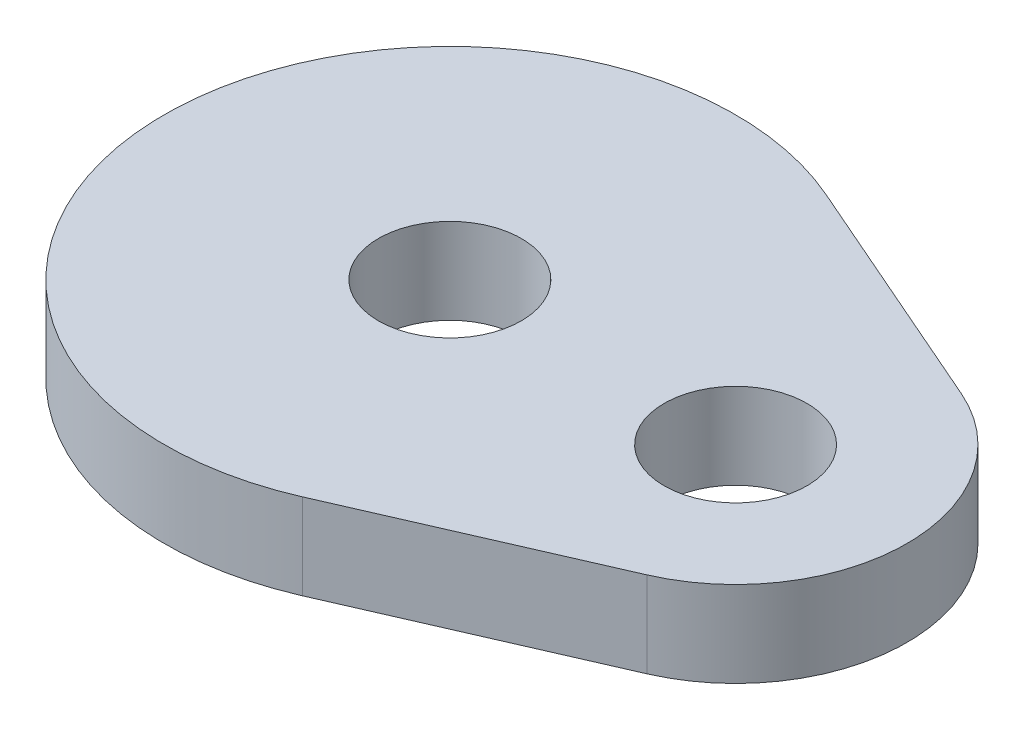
ISO-10303-21;
HEADER;
FILE_DESCRIPTION(('STEP AP214'),'2;1');
FILE_NAME('part.step','',(''),(''),'','','');
FILE_SCHEMA(('AUTOMOTIVE_DESIGN { 1 0 10303 214 1 1 1 1 }'));
ENDSEC;
DATA;
#1=APPLICATION_CONTEXT('core data for automotive mechanical design processes');
#2=APPLICATION_PROTOCOL_DEFINITION('international standard','automotive_design',2000,#1);
#3=PRODUCT_CONTEXT('',#1,'mechanical');
#4=PRODUCT('Part','Part','',(#3));
#5=PRODUCT_RELATED_PRODUCT_CATEGORY('part','',(#4));
#6=PRODUCT_DEFINITION_FORMATION('','',#4);
#7=PRODUCT_DEFINITION_CONTEXT('part definition',#1,'design');
#8=PRODUCT_DEFINITION('design','',#6,#7);
#9=PRODUCT_DEFINITION_SHAPE('','',#8);
#10=(LENGTH_UNIT() NAMED_UNIT(*) SI_UNIT(.MILLI.,.METRE.));
#11=(NAMED_UNIT(*) PLANE_ANGLE_UNIT() SI_UNIT($,.RADIAN.));
#12=(NAMED_UNIT(*) SI_UNIT($,.STERADIAN.) SOLID_ANGLE_UNIT());
#13=UNCERTAINTY_MEASURE_WITH_UNIT(LENGTH_MEASURE(1.E-05),#10,'distance_accuracy_value','');
#14=(GEOMETRIC_REPRESENTATION_CONTEXT(3) GLOBAL_UNCERTAINTY_ASSIGNED_CONTEXT((#13)) GLOBAL_UNIT_ASSIGNED_CONTEXT((#10,
#11,#12)) REPRESENTATION_CONTEXT('',''));
#15=CARTESIAN_POINT('',(0.,0.,0.));
#16=DIRECTION('',(0.,0.,1.));
#17=DIRECTION('',(1.,0.,0.));
#18=AXIS2_PLACEMENT_3D('',#15,#16,#17);
#19=CARTESIAN_POINT('',(0.,3.,0.));
#20=DIRECTION('',(0.,1.,0.));
#21=DIRECTION('',(0.,0.,1.));
#22=AXIS2_PLACEMENT_3D('',#19,#20,#21);
#23=PLANE('',#22);
#24=CARTESIAN_POINT('',(0.,3.,0.));
#25=DIRECTION('',(0.,1.,0.));
#26=DIRECTION('',(0.,0.,1.));
#27=AXIS2_PLACEMENT_3D('',#24,#25,#26);
#28=CIRCLE('',#27,2.5);
#29=CARTESIAN_POINT('',(0.,3.,2.5));
#30=VERTEX_POINT('',#29);
#31=EDGE_CURVE('E91',#30,#30,#28,.T.);
#32=ORIENTED_EDGE('',*,*,#31,.F.);
#33=EDGE_LOOP('',(#32));
#34=FACE_BOUND('',#33,.T.);
#35=CARTESIAN_POINT('',(0.,3.,0.));
#36=DIRECTION('',(0.,1.,0.));
#37=DIRECTION('',(0.,0.,1.));
#38=AXIS2_PLACEMENT_3D('',#35,#36,#37);
#39=CIRCLE('',#38,10.);
#40=CARTESIAN_POINT('',(4.,3.,-9.16515138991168));
#41=VERTEX_POINT('',#40);
#42=CARTESIAN_POINT('',(4.,3.,9.16515138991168));
#43=VERTEX_POINT('',#42);
#44=EDGE_CURVE('E101',#41,#43,#39,.T.);
#45=ORIENTED_EDGE('',*,*,#44,.T.);
#46=DIRECTION('',(0.916515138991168,0.,-0.4));
#47=VECTOR('',#46,1.);
#48=CARTESIAN_POINT('',(4.,3.,9.16515138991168));
#49=LINE('',#48,#47);
#50=CARTESIAN_POINT('',(12.4,3.,5.49909083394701));
#51=VERTEX_POINT('',#50);
#52=EDGE_CURVE('E86',#43,#51,#49,.T.);
#53=ORIENTED_EDGE('',*,*,#52,.T.);
#54=CARTESIAN_POINT('',(10.,3.,0.));
#55=DIRECTION('',(0.,1.,0.));
#56=DIRECTION('',(0.,0.,1.));
#57=AXIS2_PLACEMENT_3D('',#54,#55,#56);
#58=CIRCLE('',#57,6.);
#59=CARTESIAN_POINT('',(12.4,3.,-5.49909083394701));
#60=VERTEX_POINT('',#59);
#61=EDGE_CURVE('E52',#51,#60,#58,.T.);
#62=ORIENTED_EDGE('',*,*,#61,.T.);
#63=DIRECTION('',(-0.916515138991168,0.,-0.4));
#64=VECTOR('',#63,1.);
#65=CARTESIAN_POINT('',(4.,3.,-9.16515138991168));
#66=LINE('',#65,#64);
#67=EDGE_CURVE('E47',#60,#41,#66,.T.);
#68=ORIENTED_EDGE('',*,*,#67,.T.);
#69=EDGE_LOOP('',(#45,#53,#62,#68));
#70=FACE_BOUND('',#69,.T.);
#71=CARTESIAN_POINT('',(10.,3.,0.));
#72=DIRECTION('',(0.,1.,0.));
#73=DIRECTION('',(0.,0.,1.));
#74=AXIS2_PLACEMENT_3D('',#71,#72,#73);
#75=CIRCLE('',#74,2.5);
#76=CARTESIAN_POINT('',(10.,3.,2.5));
#77=VERTEX_POINT('',#76);
#78=EDGE_CURVE('E119',#77,#77,#75,.T.);
#79=ORIENTED_EDGE('',*,*,#78,.F.);
#80=EDGE_LOOP('',(#79));
#81=FACE_BOUND('',#80,.T.);
#82=ADVANCED_FACE('F32',(#34,#70,#81),#23,.T.);
#83=CARTESIAN_POINT('',(0.,0.,0.));
#84=DIRECTION('',(0.,1.,0.));
#85=DIRECTION('',(0.,0.,1.));
#86=AXIS2_PLACEMENT_3D('',#83,#84,#85);
#87=PLANE('',#86);
#88=CARTESIAN_POINT('',(0.,0.,0.));
#89=DIRECTION('',(0.,1.,0.));
#90=DIRECTION('',(0.,0.,1.));
#91=AXIS2_PLACEMENT_3D('',#88,#89,#90);
#92=CIRCLE('',#91,2.5);
#93=CARTESIAN_POINT('',(0.,0.,2.5));
#94=VERTEX_POINT('',#93);
#95=EDGE_CURVE('E94',#94,#94,#92,.T.);
#96=ORIENTED_EDGE('',*,*,#95,.T.);
#97=EDGE_LOOP('',(#96));
#98=FACE_BOUND('',#97,.T.);
#99=CARTESIAN_POINT('',(0.,0.,0.));
#100=DIRECTION('',(0.,1.,0.));
#101=DIRECTION('',(0.,0.,1.));
#102=AXIS2_PLACEMENT_3D('',#99,#100,#101);
#103=CIRCLE('',#102,10.);
#104=CARTESIAN_POINT('',(4.,0.,-9.16515138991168));
#105=VERTEX_POINT('',#104);
#106=CARTESIAN_POINT('',(4.,0.,9.16515138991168));
#107=VERTEX_POINT('',#106);
#108=EDGE_CURVE('E78',#105,#107,#103,.T.);
#109=ORIENTED_EDGE('',*,*,#108,.F.);
#110=DIRECTION('',(-0.916515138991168,0.,-0.4));
#111=VECTOR('',#110,1.);
#112=CARTESIAN_POINT('',(4.,0.,-9.16515138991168));
#113=LINE('',#112,#111);
#114=CARTESIAN_POINT('',(12.4,0.,-5.49909083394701));
#115=VERTEX_POINT('',#114);
#116=EDGE_CURVE('E99',#115,#105,#113,.T.);
#117=ORIENTED_EDGE('',*,*,#116,.F.);
#118=CARTESIAN_POINT('',(10.,0.,0.));
#119=DIRECTION('',(0.,1.,0.));
#120=DIRECTION('',(0.,0.,1.));
#121=AXIS2_PLACEMENT_3D('',#118,#119,#120);
#122=CIRCLE('',#121,6.);
#123=CARTESIAN_POINT('',(12.4,0.,5.49909083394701));
#124=VERTEX_POINT('',#123);
#125=EDGE_CURVE('E79',#124,#115,#122,.T.);
#126=ORIENTED_EDGE('',*,*,#125,.F.);
#127=DIRECTION('',(0.916515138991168,0.,-0.4));
#128=VECTOR('',#127,1.);
#129=CARTESIAN_POINT('',(4.,0.,9.16515138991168));
#130=LINE('',#129,#128);
#131=EDGE_CURVE('E73',#107,#124,#130,.T.);
#132=ORIENTED_EDGE('',*,*,#131,.F.);
#133=EDGE_LOOP('',(#109,#117,#126,#132));
#134=FACE_BOUND('',#133,.T.);
#135=CARTESIAN_POINT('',(10.,0.,0.));
#136=DIRECTION('',(0.,1.,0.));
#137=DIRECTION('',(0.,0.,1.));
#138=AXIS2_PLACEMENT_3D('',#135,#136,#137);
#139=CIRCLE('',#138,2.5);
#140=CARTESIAN_POINT('',(10.,0.,2.5));
#141=VERTEX_POINT('',#140);
#142=EDGE_CURVE('E121',#141,#141,#139,.T.);
#143=ORIENTED_EDGE('',*,*,#142,.T.);
#144=EDGE_LOOP('',(#143));
#145=FACE_BOUND('',#144,.T.);
#146=ADVANCED_FACE('F74',(#98,#134,#145),#87,.F.);
#147=CARTESIAN_POINT('',(0.,3.,0.));
#148=DIRECTION('',(0.,-1.,0.));
#149=DIRECTION('',(0.,0.,-1.));
#150=AXIS2_PLACEMENT_3D('',#147,#148,#149);
#151=CYLINDRICAL_SURFACE('',#150,10.);
#152=ORIENTED_EDGE('',*,*,#108,.T.);
#153=DIRECTION('',(0.,-1.,0.));
#154=VECTOR('',#153,1.);
#155=CARTESIAN_POINT('',(4.,3.,9.16515138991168));
#156=LINE('',#155,#154);
#157=EDGE_CURVE('E11',#43,#107,#156,.T.);
#158=ORIENTED_EDGE('',*,*,#157,.F.);
#159=ORIENTED_EDGE('',*,*,#44,.F.);
#160=DIRECTION('',(0.,-1.,0.));
#161=VECTOR('',#160,1.);
#162=CARTESIAN_POINT('',(4.,3.,-9.16515138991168));
#163=LINE('',#162,#161);
#164=EDGE_CURVE('E90',#41,#105,#163,.T.);
#165=ORIENTED_EDGE('',*,*,#164,.T.);
#166=EDGE_LOOP('',(#152,#158,#159,#165));
#167=FACE_BOUND('',#166,.T.);
#168=ADVANCED_FACE('F34',(#167),#151,.T.);
#169=CARTESIAN_POINT('',(4.,3.,9.16515138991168));
#170=DIRECTION('',(-0.4,0.,-0.916515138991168));
#171=DIRECTION('',(-0.916515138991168,0.,0.4));
#172=AXIS2_PLACEMENT_3D('',#169,#170,#171);
#173=PLANE('',#172);
#174=ORIENTED_EDGE('',*,*,#131,.T.);
#175=DIRECTION('',(0.,-1.,0.));
#176=VECTOR('',#175,1.);
#177=CARTESIAN_POINT('',(12.4,3.,5.49909083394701));
#178=LINE('',#177,#176);
#179=EDGE_CURVE('E40',#51,#124,#178,.T.);
#180=ORIENTED_EDGE('',*,*,#179,.F.);
#181=ORIENTED_EDGE('',*,*,#52,.F.);
#182=ORIENTED_EDGE('',*,*,#157,.T.);
#183=EDGE_LOOP('',(#174,#180,#181,#182));
#184=FACE_BOUND('',#183,.T.);
#185=ADVANCED_FACE('F85',(#184),#173,.F.);
#186=CARTESIAN_POINT('',(10.,3.,0.));
#187=DIRECTION('',(0.,-1.,0.));
#188=DIRECTION('',(0.,0.,-1.));
#189=AXIS2_PLACEMENT_3D('',#186,#187,#188);
#190=CYLINDRICAL_SURFACE('',#189,6.);
#191=ORIENTED_EDGE('',*,*,#125,.T.);
#192=DIRECTION('',(0.,-1.,0.));
#193=VECTOR('',#192,1.);
#194=CARTESIAN_POINT('',(12.4,3.,-5.49909083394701));
#195=LINE('',#194,#193);
#196=EDGE_CURVE('E107',#60,#115,#195,.T.);
#197=ORIENTED_EDGE('',*,*,#196,.F.);
#198=ORIENTED_EDGE('',*,*,#61,.F.);
#199=ORIENTED_EDGE('',*,*,#179,.T.);
#200=EDGE_LOOP('',(#191,#197,#198,#199));
#201=FACE_BOUND('',#200,.T.);
#202=ADVANCED_FACE('F110',(#201),#190,.T.);
#203=CARTESIAN_POINT('',(4.,3.,-9.16515138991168));
#204=DIRECTION('',(-0.4,0.,0.916515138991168));
#205=DIRECTION('',(0.916515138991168,0.,0.4));
#206=AXIS2_PLACEMENT_3D('',#203,#204,#205);
#207=PLANE('',#206);
#208=ORIENTED_EDGE('',*,*,#116,.T.);
#209=ORIENTED_EDGE('',*,*,#164,.F.);
#210=ORIENTED_EDGE('',*,*,#67,.F.);
#211=ORIENTED_EDGE('',*,*,#196,.T.);
#212=EDGE_LOOP('',(#208,#209,#210,#211));
#213=FACE_BOUND('',#212,.T.);
#214=ADVANCED_FACE('F112',(#213),#207,.F.);
#215=CARTESIAN_POINT('',(0.,3.,0.));
#216=DIRECTION('',(0.,-1.,0.));
#217=DIRECTION('',(0.,0.,-1.));
#218=AXIS2_PLACEMENT_3D('',#215,#216,#217);
#219=CYLINDRICAL_SURFACE('',#218,2.5);
#220=ORIENTED_EDGE('',*,*,#31,.T.);
#221=EDGE_LOOP('',(#220));
#222=FACE_BOUND('',#221,.T.);
#223=ORIENTED_EDGE('',*,*,#95,.F.);
#224=EDGE_LOOP('',(#223));
#225=FACE_BOUND('',#224,.T.);
#226=ADVANCED_FACE('F130',(#222,#225),#219,.F.);
#227=CARTESIAN_POINT('',(10.,3.,0.));
#228=DIRECTION('',(0.,-1.,0.));
#229=DIRECTION('',(0.,0.,-1.));
#230=AXIS2_PLACEMENT_3D('',#227,#228,#229);
#231=CYLINDRICAL_SURFACE('',#230,2.5);
#232=ORIENTED_EDGE('',*,*,#78,.T.);
#233=EDGE_LOOP('',(#232));
#234=FACE_BOUND('',#233,.T.);
#235=ORIENTED_EDGE('',*,*,#142,.F.);
#236=EDGE_LOOP('',(#235));
#237=FACE_BOUND('',#236,.T.);
#238=ADVANCED_FACE('F128',(#234,#237),#231,.F.);
#239=CLOSED_SHELL('',(#82,#146,#168,#185,#202,#214,#226,#238));
#240=MANIFOLD_SOLID_BREP('B2',#239);
#241=ADVANCED_BREP_SHAPE_REPRESENTATION('',(#18,#240),#14);
#242=SHAPE_DEFINITION_REPRESENTATION(#9,#241);
ENDSEC;
END-ISO-10303-21;
